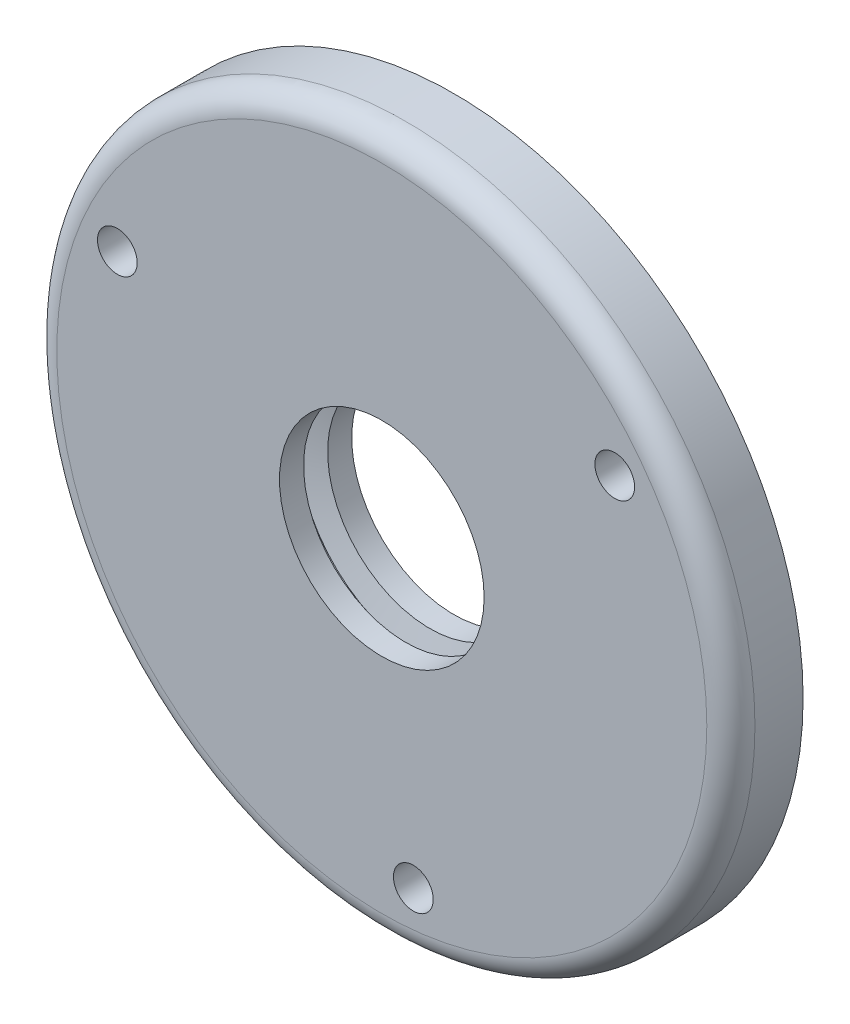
ISO-10303-21;
HEADER;
FILE_DESCRIPTION(('STEP AP214'),'2;1');
FILE_NAME('part.step','',(''),(''),'','','');
FILE_SCHEMA(('AUTOMOTIVE_DESIGN { 1 0 10303 214 1 1 1 1 }'));
ENDSEC;
DATA;
#1=APPLICATION_CONTEXT('core data for automotive mechanical design processes');
#2=APPLICATION_PROTOCOL_DEFINITION('international standard','automotive_design',2000,#1);
#3=PRODUCT_CONTEXT('',#1,'mechanical');
#4=PRODUCT('Part','Part','',(#3));
#5=PRODUCT_RELATED_PRODUCT_CATEGORY('part','',(#4));
#6=PRODUCT_DEFINITION_FORMATION('','',#4);
#7=PRODUCT_DEFINITION_CONTEXT('part definition',#1,'design');
#8=PRODUCT_DEFINITION('design','',#6,#7);
#9=PRODUCT_DEFINITION_SHAPE('','',#8);
#10=(LENGTH_UNIT() NAMED_UNIT(*) SI_UNIT(.MILLI.,.METRE.));
#11=(NAMED_UNIT(*) PLANE_ANGLE_UNIT() SI_UNIT($,.RADIAN.));
#12=(NAMED_UNIT(*) SI_UNIT($,.STERADIAN.) SOLID_ANGLE_UNIT());
#13=UNCERTAINTY_MEASURE_WITH_UNIT(LENGTH_MEASURE(1.E-05),#10,'distance_accuracy_value','');
#14=(GEOMETRIC_REPRESENTATION_CONTEXT(3) GLOBAL_UNCERTAINTY_ASSIGNED_CONTEXT((#13)) GLOBAL_UNIT_ASSIGNED_CONTEXT((#10,
#11,#12)) REPRESENTATION_CONTEXT('',''));
#15=CARTESIAN_POINT('',(0.,0.,0.));
#16=DIRECTION('',(0.,0.,1.));
#17=DIRECTION('',(1.,0.,0.));
#18=AXIS2_PLACEMENT_3D('',#15,#16,#17);
#19=CARTESIAN_POINT('',(23.1273678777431,34.5416394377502,12.));
#20=DIRECTION('',(0.,0.,-1.));
#21=DIRECTION('',(-1.,0.,0.));
#22=AXIS2_PLACEMENT_3D('',#19,#20,#21);
#23=CYLINDRICAL_SURFACE('',#22,8.5);
#24=CARTESIAN_POINT('',(23.1273678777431,34.5416394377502,12.));
#25=DIRECTION('',(0.,0.,1.));
#26=DIRECTION('',(1.,0.,0.));
#27=AXIS2_PLACEMENT_3D('',#24,#25,#26);
#28=CIRCLE('',#27,8.5);
#29=CARTESIAN_POINT('',(31.6273678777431,34.5416394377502,12.));
#30=VERTEX_POINT('',#29);
#31=EDGE_CURVE('E58',#30,#30,#28,.T.);
#32=ORIENTED_EDGE('',*,*,#31,.T.);
#33=EDGE_LOOP('',(#32));
#34=FACE_BOUND('',#33,.T.);
#35=CARTESIAN_POINT('',(23.1273678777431,34.5416394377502,9.99999999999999));
#36=DIRECTION('',(0.,0.,1.));
#37=DIRECTION('',(1.,0.,0.));
#38=AXIS2_PLACEMENT_3D('',#35,#36,#37);
#39=CIRCLE('',#38,8.5);
#40=CARTESIAN_POINT('',(31.6273678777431,34.5416394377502,9.99999999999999));
#41=VERTEX_POINT('',#40);
#42=EDGE_CURVE('E91',#41,#41,#39,.T.);
#43=ORIENTED_EDGE('',*,*,#42,.F.);
#44=EDGE_LOOP('',(#43));
#45=FACE_BOUND('',#44,.T.);
#46=ADVANCED_FACE('F29',(#34,#45),#23,.F.);
#47=CARTESIAN_POINT('',(23.1273678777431,34.5416394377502,5.99999999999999));
#48=DIRECTION('',(0.,0.,1.));
#49=DIRECTION('',(1.,0.,0.));
#50=AXIS2_PLACEMENT_3D('',#47,#48,#49);
#51=CIRCLE('',#50,8.5);
#52=CARTESIAN_POINT('',(31.6273678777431,34.5416394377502,5.99999999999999));
#53=VERTEX_POINT('',#52);
#54=EDGE_CURVE('E59',#53,#53,#51,.T.);
#55=ORIENTED_EDGE('',*,*,#54,.F.);
#56=EDGE_LOOP('',(#55));
#57=FACE_BOUND('',#56,.T.);
#58=CARTESIAN_POINT('',(23.1273678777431,34.5416394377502,7.99999999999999));
#59=DIRECTION('',(0.,0.,1.));
#60=DIRECTION('',(1.,0.,0.));
#61=AXIS2_PLACEMENT_3D('',#58,#59,#60);
#62=CIRCLE('',#61,8.5);
#63=CARTESIAN_POINT('',(31.6273678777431,34.5416394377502,7.99999999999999));
#64=VERTEX_POINT('',#63);
#65=EDGE_CURVE('E88',#64,#64,#62,.T.);
#66=ORIENTED_EDGE('',*,*,#65,.T.);
#67=EDGE_LOOP('',(#66));
#68=FACE_BOUND('',#67,.T.);
#69=ADVANCED_FACE('F99',(#57,#68),#23,.F.);
#70=CARTESIAN_POINT('',(23.1273678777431,34.5416394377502,64.5685424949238));
#71=DIRECTION('',(0.,0.,-1.));
#72=DIRECTION('',(-1.,0.,0.));
#73=AXIS2_PLACEMENT_3D('',#70,#71,#72);
#74=CYLINDRICAL_SURFACE('',#73,20.);
#75=CARTESIAN_POINT('',(23.1273678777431,34.5416394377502,1.25));
#76=DIRECTION('',(0.,0.,1.));
#77=DIRECTION('',(1.,0.,0.));
#78=AXIS2_PLACEMENT_3D('',#75,#76,#77);
#79=CIRCLE('',#78,20.);
#80=CARTESIAN_POINT('',(43.1273678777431,34.5416394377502,1.25));
#81=VERTEX_POINT('',#80);
#82=EDGE_CURVE('E44',#81,#81,#79,.T.);
#83=ORIENTED_EDGE('',*,*,#82,.T.);
#84=EDGE_LOOP('',(#83));
#85=FACE_BOUND('',#84,.T.);
#86=CARTESIAN_POINT('',(23.1273678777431,34.5416394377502,5.99999999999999));
#87=DIRECTION('',(0.,0.,1.));
#88=DIRECTION('',(0.,-1.,0.));
#89=AXIS2_PLACEMENT_3D('',#86,#87,#88);
#90=CIRCLE('',#89,20.);
#91=CARTESIAN_POINT('',(23.1273678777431,14.5416394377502,5.99999999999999));
#92=VERTEX_POINT('',#91);
#93=EDGE_CURVE('E40',#92,#92,#90,.T.);
#94=ORIENTED_EDGE('',*,*,#93,.F.);
#95=EDGE_LOOP('',(#94));
#96=FACE_BOUND('',#95,.T.);
#97=ADVANCED_FACE('F105',(#85,#96),#74,.T.);
#98=CARTESIAN_POINT('',(23.1273678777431,34.5416394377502,1.25));
#99=DIRECTION('',(0.,0.,1.));
#100=DIRECTION('',(1.,0.,0.));
#101=AXIS2_PLACEMENT_3D('',#98,#99,#100);
#102=PLANE('',#101);
#103=ORIENTED_EDGE('',*,*,#82,.F.);
#104=EDGE_LOOP('',(#103));
#105=FACE_BOUND('',#104,.T.);
#106=CARTESIAN_POINT('',(23.1273678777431,34.5416394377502,1.25));
#107=DIRECTION('',(0.,0.,1.));
#108=DIRECTION('',(1.,0.,0.));
#109=AXIS2_PLACEMENT_3D('',#106,#107,#108);
#110=CIRCLE('',#109,15.704);
#111=CARTESIAN_POINT('',(38.8313678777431,34.5416394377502,1.25));
#112=VERTEX_POINT('',#111);
#113=EDGE_CURVE('E49',#112,#112,#110,.T.);
#114=ORIENTED_EDGE('',*,*,#113,.T.);
#115=EDGE_LOOP('',(#114));
#116=FACE_BOUND('',#115,.T.);
#117=ADVANCED_FACE('F125',(#105,#116),#102,.F.);
#118=CARTESIAN_POINT('',(23.1273678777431,34.5416394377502,64.5685424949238));
#119=DIRECTION('',(0.,0.,-1.));
#120=DIRECTION('',(-1.,0.,0.));
#121=AXIS2_PLACEMENT_3D('',#118,#119,#120);
#122=CYLINDRICAL_SURFACE('',#121,15.704);
#123=ORIENTED_EDGE('',*,*,#113,.F.);
#124=EDGE_LOOP('',(#123));
#125=FACE_BOUND('',#124,.T.);
#126=CARTESIAN_POINT('',(23.1273678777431,34.5416394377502,5.99999999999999));
#127=DIRECTION('',(0.,0.,1.));
#128=DIRECTION('',(1.,0.,0.));
#129=AXIS2_PLACEMENT_3D('',#126,#127,#128);
#130=CIRCLE('',#129,15.704);
#131=CARTESIAN_POINT('',(38.8313678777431,34.5416394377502,5.99999999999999));
#132=VERTEX_POINT('',#131);
#133=EDGE_CURVE('E51',#132,#132,#130,.T.);
#134=ORIENTED_EDGE('',*,*,#133,.T.);
#135=EDGE_LOOP('',(#134));
#136=FACE_BOUND('',#135,.T.);
#137=ADVANCED_FACE('F122',(#125,#136),#122,.F.);
#138=CARTESIAN_POINT('',(23.1273678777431,34.5416394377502,5.99999999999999));
#139=DIRECTION('',(0.,0.,1.));
#140=DIRECTION('',(1.,0.,0.));
#141=AXIS2_PLACEMENT_3D('',#138,#139,#140);
#142=PLANE('',#141);
#143=CARTESIAN_POINT('',(42.4785763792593,48.7377913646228,5.99999999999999));
#144=DIRECTION('',(0.,0.,1.));
#145=DIRECTION('',(1.,0.,0.));
#146=AXIS2_PLACEMENT_3D('',#143,#144,#145);
#147=CIRCLE('',#146,1.64999999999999);
#148=CARTESIAN_POINT('',(44.1285763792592,48.7377913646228,5.99999999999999));
#149=VERTEX_POINT('',#148);
#150=EDGE_CURVE('E76',#149,#149,#147,.T.);
#151=ORIENTED_EDGE('',*,*,#150,.T.);
#152=EDGE_LOOP('',(#151));
#153=FACE_BOUND('',#152,.T.);
#154=CARTESIAN_POINT('',(1.15753542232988,44.2022016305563,5.99999999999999));
#155=DIRECTION('',(0.,0.,1.));
#156=DIRECTION('',(1.,0.,0.));
#157=AXIS2_PLACEMENT_3D('',#154,#155,#156);
#158=CIRCLE('',#157,1.64999999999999);
#159=CARTESIAN_POINT('',(2.80753542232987,44.2022016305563,5.99999999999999));
#160=VERTEX_POINT('',#159);
#161=EDGE_CURVE('E70',#160,#160,#158,.T.);
#162=ORIENTED_EDGE('',*,*,#161,.T.);
#163=EDGE_LOOP('',(#162));
#164=FACE_BOUND('',#163,.T.);
#165=CARTESIAN_POINT('',(25.7459918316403,10.6849253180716,5.99999999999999));
#166=DIRECTION('',(0.,0.,1.));
#167=DIRECTION('',(1.,0.,0.));
#168=AXIS2_PLACEMENT_3D('',#165,#166,#167);
#169=CIRCLE('',#168,1.64999999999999);
#170=CARTESIAN_POINT('',(27.3959918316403,10.6849253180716,5.99999999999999));
#171=VERTEX_POINT('',#170);
#172=EDGE_CURVE('E62',#171,#171,#169,.T.);
#173=ORIENTED_EDGE('',*,*,#172,.T.);
#174=EDGE_LOOP('',(#173));
#175=FACE_BOUND('',#174,.T.);
#176=CARTESIAN_POINT('',(23.1273678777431,34.5416394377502,5.99999999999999));
#177=DIRECTION('',(0.,0.,1.));
#178=DIRECTION('',(1.,0.,0.));
#179=AXIS2_PLACEMENT_3D('',#176,#177,#178);
#180=CIRCLE('',#179,29.);
#181=CARTESIAN_POINT('',(52.1273678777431,34.5416394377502,5.99999999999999));
#182=VERTEX_POINT('',#181);
#183=EDGE_CURVE('E55',#182,#182,#180,.T.);
#184=ORIENTED_EDGE('',*,*,#183,.F.);
#185=EDGE_LOOP('',(#184));
#186=FACE_BOUND('',#185,.T.);
#187=ORIENTED_EDGE('',*,*,#93,.T.);
#188=EDGE_LOOP('',(#187));
#189=FACE_BOUND('',#188,.T.);
#190=ADVANCED_FACE('F115',(#153,#164,#175,#186,#189),#142,.F.);
#191=CARTESIAN_POINT('',(23.1273678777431,34.5416394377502,12.));
#192=DIRECTION('',(0.,0.,1.));
#193=DIRECTION('',(1.,0.,0.));
#194=AXIS2_PLACEMENT_3D('',#191,#192,#193);
#195=PLANE('',#194);
#196=CARTESIAN_POINT('',(23.1273678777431,34.5416394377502,12.));
#197=DIRECTION('',(0.,0.,1.));
#198=DIRECTION('',(1.,0.,0.));
#199=AXIS2_PLACEMENT_3D('',#196,#197,#198);
#200=CIRCLE('',#199,27.);
#201=CARTESIAN_POINT('',(50.1273678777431,34.5416394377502,12.));
#202=VERTEX_POINT('',#201);
#203=EDGE_CURVE('E36',#202,#202,#200,.T.);
#204=ORIENTED_EDGE('',*,*,#203,.T.);
#205=EDGE_LOOP('',(#204));
#206=FACE_BOUND('',#205,.T.);
#207=CARTESIAN_POINT('',(42.4785763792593,48.7377913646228,12.));
#208=DIRECTION('',(0.,0.,1.));
#209=DIRECTION('',(1.,0.,0.));
#210=AXIS2_PLACEMENT_3D('',#207,#208,#209);
#211=CIRCLE('',#210,1.64999999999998);
#212=CARTESIAN_POINT('',(44.1285763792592,48.7377913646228,12.));
#213=VERTEX_POINT('',#212);
#214=EDGE_CURVE('E79',#213,#213,#211,.T.);
#215=ORIENTED_EDGE('',*,*,#214,.F.);
#216=EDGE_LOOP('',(#215));
#217=FACE_BOUND('',#216,.T.);
#218=CARTESIAN_POINT('',(1.15753542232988,44.2022016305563,12.));
#219=DIRECTION('',(0.,0.,1.));
#220=DIRECTION('',(1.,0.,0.));
#221=AXIS2_PLACEMENT_3D('',#218,#219,#220);
#222=CIRCLE('',#221,1.64999999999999);
#223=CARTESIAN_POINT('',(2.80753542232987,44.2022016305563,12.));
#224=VERTEX_POINT('',#223);
#225=EDGE_CURVE('E73',#224,#224,#222,.T.);
#226=ORIENTED_EDGE('',*,*,#225,.F.);
#227=EDGE_LOOP('',(#226));
#228=FACE_BOUND('',#227,.T.);
#229=CARTESIAN_POINT('',(25.7459918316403,10.6849253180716,12.));
#230=DIRECTION('',(0.,0.,1.));
#231=DIRECTION('',(1.,0.,0.));
#232=AXIS2_PLACEMENT_3D('',#229,#230,#231);
#233=CIRCLE('',#232,1.64999999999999);
#234=CARTESIAN_POINT('',(27.3959918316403,10.6849253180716,12.));
#235=VERTEX_POINT('',#234);
#236=EDGE_CURVE('E67',#235,#235,#233,.T.);
#237=ORIENTED_EDGE('',*,*,#236,.F.);
#238=EDGE_LOOP('',(#237));
#239=FACE_BOUND('',#238,.T.);
#240=ORIENTED_EDGE('',*,*,#31,.F.);
#241=EDGE_LOOP('',(#240));
#242=FACE_BOUND('',#241,.T.);
#243=ADVANCED_FACE('F111',(#206,#217,#228,#239,#242),#195,.T.);
#244=ORIENTED_EDGE('',*,*,#133,.F.);
#245=EDGE_LOOP('',(#244));
#246=FACE_BOUND('',#245,.T.);
#247=ORIENTED_EDGE('',*,*,#54,.T.);
#248=EDGE_LOOP('',(#247));
#249=FACE_BOUND('',#248,.T.);
#250=ADVANCED_FACE('F114',(#246,#249),#142,.F.);
#251=CARTESIAN_POINT('',(23.1273678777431,34.5416394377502,12.));
#252=DIRECTION('',(0.,0.,-1.));
#253=DIRECTION('',(-1.,0.,0.));
#254=AXIS2_PLACEMENT_3D('',#251,#252,#253);
#255=CYLINDRICAL_SURFACE('',#254,29.);
#256=CARTESIAN_POINT('',(23.1273678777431,34.5416394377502,9.99999999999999));
#257=DIRECTION('',(0.,0.,1.));
#258=DIRECTION('',(1.,0.,0.));
#259=AXIS2_PLACEMENT_3D('',#256,#257,#258);
#260=CIRCLE('',#259,29.);
#261=CARTESIAN_POINT('',(52.1273678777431,34.5416394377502,9.99999999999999));
#262=VERTEX_POINT('',#261);
#263=EDGE_CURVE('E10',#262,#262,#260,.F.);
#264=ORIENTED_EDGE('',*,*,#263,.T.);
#265=EDGE_LOOP('',(#264));
#266=FACE_BOUND('',#265,.T.);
#267=ORIENTED_EDGE('',*,*,#183,.T.);
#268=EDGE_LOOP('',(#267));
#269=FACE_BOUND('',#268,.T.);
#270=ADVANCED_FACE('F118',(#266,#269),#255,.T.);
#271=CARTESIAN_POINT('',(25.7459918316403,10.6849253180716,12.));
#272=DIRECTION('',(0.,0.,1.));
#273=DIRECTION('',(1.,0.,0.));
#274=AXIS2_PLACEMENT_3D('',#271,#272,#273);
#275=CYLINDRICAL_SURFACE('',#274,1.64999999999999);
#276=ORIENTED_EDGE('',*,*,#236,.T.);
#277=EDGE_LOOP('',(#276));
#278=FACE_BOUND('',#277,.T.);
#279=ORIENTED_EDGE('',*,*,#172,.F.);
#280=EDGE_LOOP('',(#279));
#281=FACE_BOUND('',#280,.T.);
#282=ADVANCED_FACE('F109',(#278,#281),#275,.F.);
#283=CARTESIAN_POINT('',(1.15753542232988,44.2022016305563,12.));
#284=DIRECTION('',(0.,0.,1.));
#285=DIRECTION('',(1.,0.,0.));
#286=AXIS2_PLACEMENT_3D('',#283,#284,#285);
#287=CYLINDRICAL_SURFACE('',#286,1.64999999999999);
#288=ORIENTED_EDGE('',*,*,#225,.T.);
#289=EDGE_LOOP('',(#288));
#290=FACE_BOUND('',#289,.T.);
#291=ORIENTED_EDGE('',*,*,#161,.F.);
#292=EDGE_LOOP('',(#291));
#293=FACE_BOUND('',#292,.T.);
#294=ADVANCED_FACE('F151',(#290,#293),#287,.F.);
#295=CARTESIAN_POINT('',(42.4785763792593,48.7377913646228,12.));
#296=DIRECTION('',(0.,0.,1.));
#297=DIRECTION('',(1.,0.,0.));
#298=AXIS2_PLACEMENT_3D('',#295,#296,#297);
#299=CYLINDRICAL_SURFACE('',#298,1.64999999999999);
#300=ORIENTED_EDGE('',*,*,#214,.T.);
#301=EDGE_LOOP('',(#300));
#302=FACE_BOUND('',#301,.T.);
#303=ORIENTED_EDGE('',*,*,#150,.F.);
#304=EDGE_LOOP('',(#303));
#305=FACE_BOUND('',#304,.T.);
#306=ADVANCED_FACE('F156',(#302,#305),#299,.F.);
#307=CARTESIAN_POINT('',(23.1273678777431,34.5416394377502,9.99999999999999));
#308=DIRECTION('',(0.,0.,1.));
#309=DIRECTION('',(1.,0.,0.));
#310=AXIS2_PLACEMENT_3D('',#307,#308,#309);
#311=TOROIDAL_SURFACE('',#310,27.,2.);
#312=ORIENTED_EDGE('',*,*,#263,.F.);
#313=EDGE_LOOP('',(#312));
#314=FACE_BOUND('',#313,.T.);
#315=ORIENTED_EDGE('',*,*,#203,.F.);
#316=EDGE_LOOP('',(#315));
#317=FACE_BOUND('',#316,.T.);
#318=ADVANCED_FACE('F31',(#314,#317),#311,.T.);
#319=CARTESIAN_POINT('',(23.1273678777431,34.5416394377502,9.49999999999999));
#320=DIRECTION('',(0.,0.,-1.));
#321=DIRECTION('',(-1.,0.,0.));
#322=AXIS2_PLACEMENT_3D('',#319,#320,#321);
#323=CONICAL_SURFACE('',#322,10.5,1.32581766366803);
#324=ORIENTED_EDGE('',*,*,#42,.T.);
#325=EDGE_LOOP('',(#324));
#326=FACE_BOUND('',#325,.T.);
#327=CARTESIAN_POINT('',(23.1273678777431,34.5416394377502,9.49999999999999));
#328=DIRECTION('',(0.,0.,1.));
#329=DIRECTION('',(1.,0.,0.));
#330=AXIS2_PLACEMENT_3D('',#327,#328,#329);
#331=CIRCLE('',#330,10.5);
#332=CARTESIAN_POINT('',(33.6273678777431,34.5416394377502,9.49999999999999));
#333=VERTEX_POINT('',#332);
#334=EDGE_CURVE('E82',#333,#333,#331,.T.);
#335=ORIENTED_EDGE('',*,*,#334,.F.);
#336=EDGE_LOOP('',(#335));
#337=FACE_BOUND('',#336,.T.);
#338=ADVANCED_FACE('F95',(#326,#337),#323,.F.);
#339=CARTESIAN_POINT('',(23.1273678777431,34.5416394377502,12.));
#340=DIRECTION('',(0.,0.,1.));
#341=DIRECTION('',(1.,0.,0.));
#342=AXIS2_PLACEMENT_3D('',#339,#340,#341);
#343=CYLINDRICAL_SURFACE('',#342,10.5);
#344=ORIENTED_EDGE('',*,*,#334,.T.);
#345=EDGE_LOOP('',(#344));
#346=FACE_BOUND('',#345,.T.);
#347=CARTESIAN_POINT('',(23.1273678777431,34.5416394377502,8.49999999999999));
#348=DIRECTION('',(0.,0.,1.));
#349=DIRECTION('',(1.,0.,0.));
#350=AXIS2_PLACEMENT_3D('',#347,#348,#349);
#351=CIRCLE('',#350,10.5);
#352=CARTESIAN_POINT('',(33.6273678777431,34.5416394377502,8.49999999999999));
#353=VERTEX_POINT('',#352);
#354=EDGE_CURVE('E85',#353,#353,#351,.T.);
#355=ORIENTED_EDGE('',*,*,#354,.F.);
#356=EDGE_LOOP('',(#355));
#357=FACE_BOUND('',#356,.T.);
#358=ADVANCED_FACE('F171',(#346,#357),#343,.F.);
#359=CARTESIAN_POINT('',(23.1273678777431,34.5416394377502,7.99999999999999));
#360=DIRECTION('',(0.,0.,1.));
#361=DIRECTION('',(1.,0.,0.));
#362=AXIS2_PLACEMENT_3D('',#359,#360,#361);
#363=CONICAL_SURFACE('',#362,8.5,1.32581766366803);
#364=ORIENTED_EDGE('',*,*,#354,.T.);
#365=EDGE_LOOP('',(#364));
#366=FACE_BOUND('',#365,.T.);
#367=ORIENTED_EDGE('',*,*,#65,.F.);
#368=EDGE_LOOP('',(#367));
#369=FACE_BOUND('',#368,.T.);
#370=ADVANCED_FACE('F174',(#366,#369),#363,.F.);
#371=CLOSED_SHELL('',(#46,#69,#97,#117,#137,#190,#243,#250,#270,#282,#294,#306,#318,#338,#358,#370));
#372=MANIFOLD_SOLID_BREP('B2',#371);
#373=ADVANCED_BREP_SHAPE_REPRESENTATION('',(#18,#372),#14);
#374=SHAPE_DEFINITION_REPRESENTATION(#9,#373);
ENDSEC;
END-ISO-10303-21;
